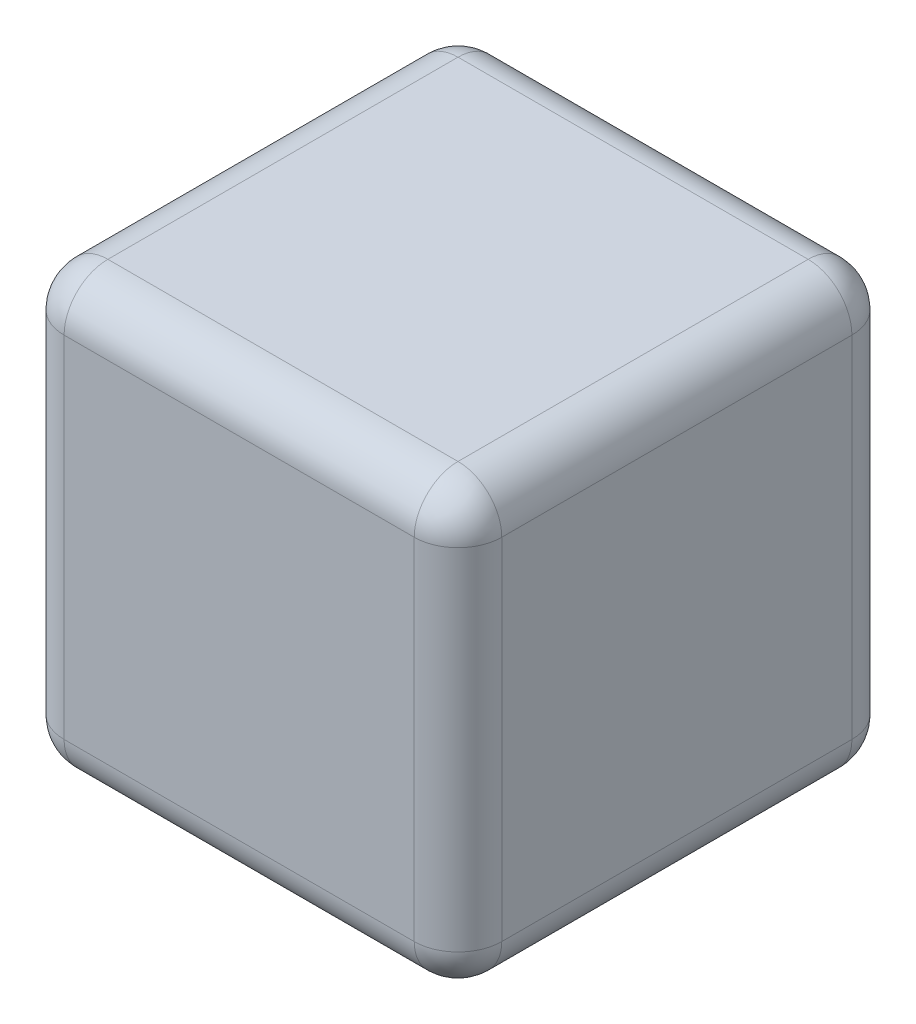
from build123d import *

# Parameters (mm, degrees)
SKETCH1_W           = 5
SKETCH1_H           = 5
BOSS_EXTRUDE1_DEPTH = 5
FILLET1_R           = 0.5


with BuildPart() as part:
    # Sketch1 → Boss-Extrude1 (new body)
    with BuildSketch(Plane(origin=(0, 0, 0), x_dir=(1, 0, 0), z_dir=(0, 1, 0))):
        Rectangle(SKETCH1_W, SKETCH1_H)
    extrude(amount=BOSS_EXTRUDE1_DEPTH)

    # Fillet1
    fillet1_edges = [part.edges().sort_by_distance(p)[0] for p in [
        (-2.5, 5, 0),
        (0, 5, 2.5),
        (2.5, 5, 0),
        (0, 0, 2.5),
        (-2.5, 0, 0),
        (0, 0, -2.5),
        (2.5, 0, 0),
        (0, 5, -2.5),
        (2.5, 2.5, 2.5),
        (-2.5, 2.5, 2.5),
        (-2.5, 2.5, -2.5),
        (2.5, 2.5, -2.5),
    ]]
    fillet(fillet1_edges, radius=FILLET1_R)


solid = part.part
